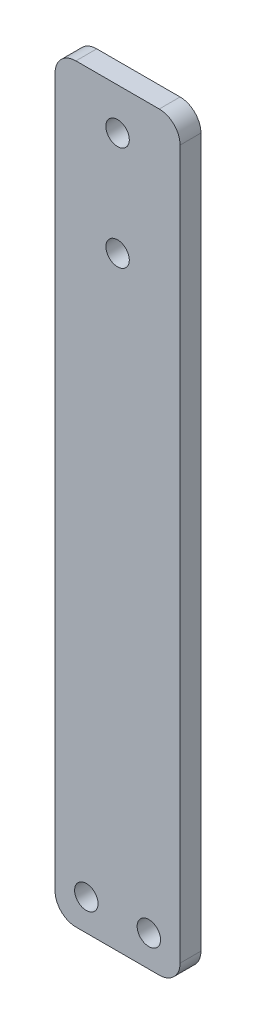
from build123d import *

# Parameters (mm, degrees)
SKETCH1_W           = 38.1
SKETCH1_H           = 228.6
SKETCH1_R           = 3.571875
BOSS_EXTRUDE1_DEPTH = 6.35
FILLET1_R           = 6.35
SKETCH2_R           = 3.571875
CUT_EXTRUDE1_DEPTH  = 117.050484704


with BuildPart() as part:
    # Sketch1 → Boss-Extrude1 (new body)
    with BuildSketch(Plane.XY):
        Rectangle(SKETCH1_W, SKETCH1_H)
        with Locations((0, 101.6)):
            Circle(SKETCH1_R, mode=Mode.SUBTRACT)
        with Locations((0, 69.85)):
            Circle(SKETCH1_R, mode=Mode.SUBTRACT)
    extrude(amount=BOSS_EXTRUDE1_DEPTH)

    # Fillet1
    fillet1_edges = [part.edges().sort_by_distance(p)[0] for p in [
        (19.05, -114.3, 3.175),
        (-19.05, -114.3, 3.175),
        (-19.05, 114.3, 3.175),
        (19.05, 114.3, 3.175),
    ]]
    fillet(fillet1_edges, radius=FILLET1_R)

    # Sketch2 → Cut-Extrude1 (cut, through all)
    with BuildSketch(Plane.XY.offset(6.35)):
        with Locations((-9.525, -104.775)):
            Circle(SKETCH2_R)
        with Locations((9.525, -104.775)):
            Circle(SKETCH2_R)
    extrude(amount=-CUT_EXTRUDE1_DEPTH, mode=Mode.SUBTRACT)


solid = part.part
